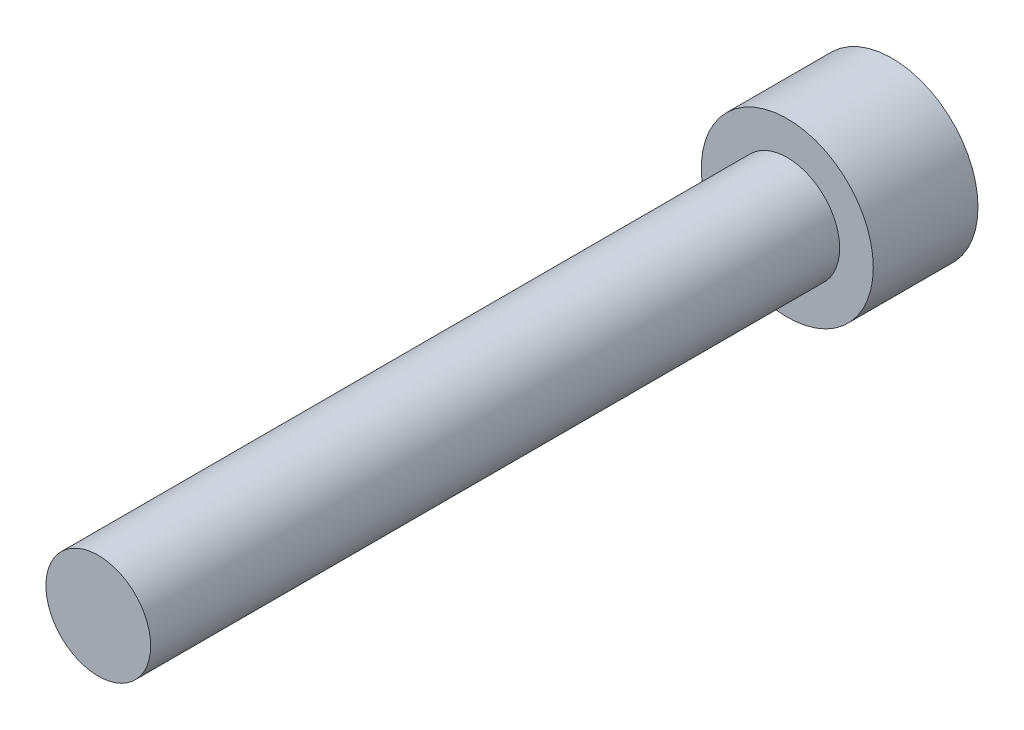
from build123d import *

# Parameters (mm, degrees)
HEX_2_DEPTH = 3.048


with BuildPart() as part:
    # Sketch6 → Revolve1 (revolve)
    with BuildSketch(Plane(origin=(0, 0, 0), x_dir=(0, 0, -1), z_dir=(1, 0, 0)), mode=Mode.PRIVATE) as revolve1_sk:
        Polygon((-31.75, 0), (-31.75, -2.413), (0, -2.413), (0, -3.9624), (4.826, -3.9624), (4.826, 0), align=None)
    revolve(revolve1_sk.sketch.rotate(Axis((0, 0, 31.75), (0, 0, -1)), 270), axis=Axis((0, 0, 31.75), (0, 0, -1)))

    # Sketch7 → HEX 2 (cut)
    with BuildSketch(Plane(origin=(0, 0, -4.826), x_dir=(-1, 0, 0), z_dir=(0, 0, -1))):
        Polygon((-1.9812, 1.143846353), (-1.9812, -1.143846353), (0, -2.287692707), (1.9812, -1.143846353), (1.9812, 1.143846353), (0, 2.287692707), align=None)
    extrude(amount=-HEX_2_DEPTH, mode=Mode.SUBTRACT)


solid = part.part
